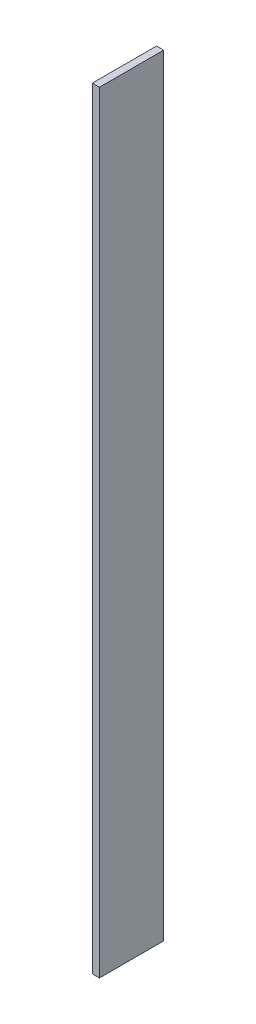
from build123d import *

# Parameters (mm, degrees)
ESQUISSE1_W          = 5
ESQUISSE1_H          = 540
BASE_EXTRUSION_DEPTH = 45


with BuildPart() as part:
    # Esquisse1 → Base-Extrusion (new body)
    with BuildSketch(Plane.XY):
        with Locations((-1017.5, 2233.4055144)):
            Rectangle(ESQUISSE1_W, ESQUISSE1_H)
    extrude(amount=BASE_EXTRUSION_DEPTH)


solid = part.part
